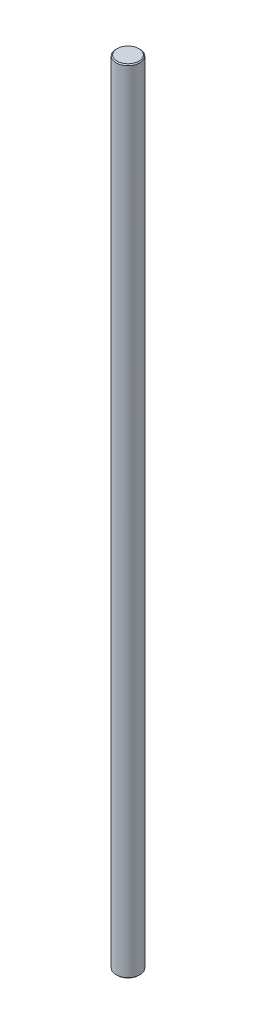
from build123d import *

# Parameters (mm, degrees)
SKETCH_1_W     = 6
SKETCH_1_H     = 400
CHAMFER_1_SIZE = 0.5


with BuildPart() as part:
    # Sketch 1 → Revolve 1 (revolve)
    with BuildSketch(Plane.XY, mode=Mode.PRIVATE) as revolve_1_sk:
        with Locations((-3, 200)):
            Rectangle(SKETCH_1_W, SKETCH_1_H)
    revolve(revolve_1_sk.sketch.rotate(Axis((0, 0, 0), (0, 1, 0)), 90), axis=Axis((0, 0, 0), (0, 1, 0)))

    # Chamfer 1
    chamfer_1_edges = [part.edges().sort_by_distance(p)[0] for p in [
        (0, 400, -6),
        (0, 0, -6),
    ]]
    chamfer(chamfer_1_edges, length=CHAMFER_1_SIZE)


solid = part.part
